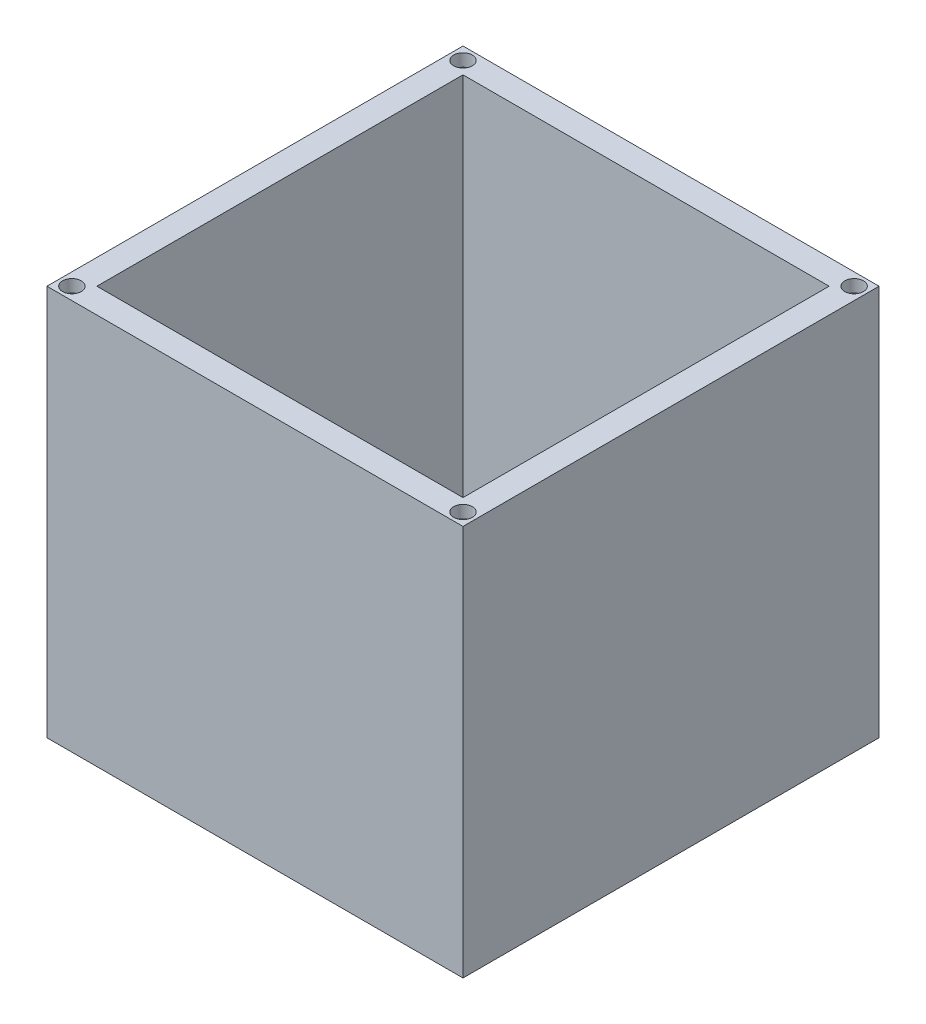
ISO-10303-21;
HEADER;
FILE_DESCRIPTION(('STEP AP214'),'2;1');
FILE_NAME('part.step','',(''),(''),'','','');
FILE_SCHEMA(('AUTOMOTIVE_DESIGN { 1 0 10303 214 1 1 1 1 }'));
ENDSEC;
DATA;
#1=APPLICATION_CONTEXT('core data for automotive mechanical design processes');
#2=APPLICATION_PROTOCOL_DEFINITION('international standard','automotive_design',2000,#1);
#3=PRODUCT_CONTEXT('',#1,'mechanical');
#4=PRODUCT('Part','Part','',(#3));
#5=PRODUCT_RELATED_PRODUCT_CATEGORY('part','',(#4));
#6=PRODUCT_DEFINITION_FORMATION('','',#4);
#7=PRODUCT_DEFINITION_CONTEXT('part definition',#1,'design');
#8=PRODUCT_DEFINITION('design','',#6,#7);
#9=PRODUCT_DEFINITION_SHAPE('','',#8);
#10=(LENGTH_UNIT() NAMED_UNIT(*) SI_UNIT(.MILLI.,.METRE.));
#11=(NAMED_UNIT(*) PLANE_ANGLE_UNIT() SI_UNIT($,.RADIAN.));
#12=(NAMED_UNIT(*) SI_UNIT($,.STERADIAN.) SOLID_ANGLE_UNIT());
#13=UNCERTAINTY_MEASURE_WITH_UNIT(LENGTH_MEASURE(1.E-05),#10,'distance_accuracy_value','');
#14=(GEOMETRIC_REPRESENTATION_CONTEXT(3) GLOBAL_UNCERTAINTY_ASSIGNED_CONTEXT((#13)) GLOBAL_UNIT_ASSIGNED_CONTEXT((#10,
#11,#12)) REPRESENTATION_CONTEXT('',''));
#15=CARTESIAN_POINT('',(0.,0.,0.));
#16=DIRECTION('',(0.,0.,1.));
#17=DIRECTION('',(1.,0.,0.));
#18=AXIS2_PLACEMENT_3D('',#15,#16,#17);
#19=CARTESIAN_POINT('',(50.,-94.,50.));
#20=DIRECTION('',(1.,0.,0.));
#21=DIRECTION('',(0.,0.,-1.));
#22=AXIS2_PLACEMENT_3D('',#19,#20,#21);
#23=PLANE('',#22);
#24=DIRECTION('',(0.,0.,-1.));
#25=VECTOR('',#24,1.);
#26=CARTESIAN_POINT('',(50.,0.,50.));
#27=LINE('',#26,#25);
#28=CARTESIAN_POINT('',(50.,0.,50.));
#29=VERTEX_POINT('',#28);
#30=CARTESIAN_POINT('',(50.,0.,-50.));
#31=VERTEX_POINT('',#30);
#32=EDGE_CURVE('E167',#29,#31,#27,.T.);
#33=ORIENTED_EDGE('',*,*,#32,.F.);
#34=DIRECTION('',(0.,1.,0.));
#35=VECTOR('',#34,1.);
#36=CARTESIAN_POINT('',(50.,-94.,50.));
#37=LINE('',#36,#35);
#38=CARTESIAN_POINT('',(50.,-94.,50.));
#39=VERTEX_POINT('',#38);
#40=EDGE_CURVE('E11',#39,#29,#37,.T.);
#41=ORIENTED_EDGE('',*,*,#40,.F.);
#42=DIRECTION('',(0.,0.,-1.));
#43=VECTOR('',#42,1.);
#44=CARTESIAN_POINT('',(50.,-94.,50.));
#45=LINE('',#44,#43);
#46=CARTESIAN_POINT('',(50.,-94.,-50.));
#47=VERTEX_POINT('',#46);
#48=EDGE_CURVE('E173',#39,#47,#45,.T.);
#49=ORIENTED_EDGE('',*,*,#48,.T.);
#50=DIRECTION('',(0.,1.,0.));
#51=VECTOR('',#50,1.);
#52=CARTESIAN_POINT('',(50.,-94.,-50.));
#53=LINE('',#52,#51);
#54=EDGE_CURVE('E48',#47,#31,#53,.T.);
#55=ORIENTED_EDGE('',*,*,#54,.T.);
#56=EDGE_LOOP('',(#33,#41,#49,#55));
#57=FACE_BOUND('',#56,.T.);
#58=ADVANCED_FACE('F45',(#57),#23,.T.);
#59=CARTESIAN_POINT('',(-50.,-94.,50.));
#60=DIRECTION('',(0.,0.,1.));
#61=DIRECTION('',(1.,0.,0.));
#62=AXIS2_PLACEMENT_3D('',#59,#60,#61);
#63=PLANE('',#62);
#64=DIRECTION('',(1.,0.,0.));
#65=VECTOR('',#64,1.);
#66=CARTESIAN_POINT('',(-50.,0.,50.));
#67=LINE('',#66,#65);
#68=CARTESIAN_POINT('',(-50.,0.,50.));
#69=VERTEX_POINT('',#68);
#70=EDGE_CURVE('E177',#69,#29,#67,.T.);
#71=ORIENTED_EDGE('',*,*,#70,.F.);
#72=DIRECTION('',(0.,1.,0.));
#73=VECTOR('',#72,1.);
#74=CARTESIAN_POINT('',(-50.,-94.,50.));
#75=LINE('',#74,#73);
#76=CARTESIAN_POINT('',(-50.,-94.,50.));
#77=VERTEX_POINT('',#76);
#78=EDGE_CURVE('E54',#77,#69,#75,.T.);
#79=ORIENTED_EDGE('',*,*,#78,.F.);
#80=DIRECTION('',(1.,0.,0.));
#81=VECTOR('',#80,1.);
#82=CARTESIAN_POINT('',(-50.,-94.,50.));
#83=LINE('',#82,#81);
#84=EDGE_CURVE('E184',#77,#39,#83,.T.);
#85=ORIENTED_EDGE('',*,*,#84,.T.);
#86=ORIENTED_EDGE('',*,*,#40,.T.);
#87=EDGE_LOOP('',(#71,#79,#85,#86));
#88=FACE_BOUND('',#87,.T.);
#89=ADVANCED_FACE('F209',(#88),#63,.T.);
#90=CARTESIAN_POINT('',(-50.,-94.,50.));
#91=DIRECTION('',(-1.,0.,0.));
#92=DIRECTION('',(0.,0.,1.));
#93=AXIS2_PLACEMENT_3D('',#90,#91,#92);
#94=PLANE('',#93);
#95=DIRECTION('',(0.,0.,1.));
#96=VECTOR('',#95,1.);
#97=CARTESIAN_POINT('',(-50.,0.,50.));
#98=LINE('',#97,#96);
#99=CARTESIAN_POINT('',(-50.,0.,-50.));
#100=VERTEX_POINT('',#99);
#101=EDGE_CURVE('E194',#100,#69,#98,.T.);
#102=ORIENTED_EDGE('',*,*,#101,.F.);
#103=DIRECTION('',(0.,1.,0.));
#104=VECTOR('',#103,1.);
#105=CARTESIAN_POINT('',(-50.,-94.,-50.));
#106=LINE('',#105,#104);
#107=CARTESIAN_POINT('',(-50.,-94.,-50.));
#108=VERTEX_POINT('',#107);
#109=EDGE_CURVE('E202',#108,#100,#106,.T.);
#110=ORIENTED_EDGE('',*,*,#109,.F.);
#111=DIRECTION('',(0.,0.,1.));
#112=VECTOR('',#111,1.);
#113=CARTESIAN_POINT('',(-50.,-94.,50.));
#114=LINE('',#113,#112);
#115=EDGE_CURVE('E180',#108,#77,#114,.T.);
#116=ORIENTED_EDGE('',*,*,#115,.T.);
#117=ORIENTED_EDGE('',*,*,#78,.T.);
#118=EDGE_LOOP('',(#102,#110,#116,#117));
#119=FACE_BOUND('',#118,.T.);
#120=ADVANCED_FACE('F213',(#119),#94,.T.);
#121=CARTESIAN_POINT('',(-50.,-94.,-50.));
#122=DIRECTION('',(0.,0.,-1.));
#123=DIRECTION('',(-1.,0.,0.));
#124=AXIS2_PLACEMENT_3D('',#121,#122,#123);
#125=PLANE('',#124);
#126=DIRECTION('',(-1.,0.,0.));
#127=VECTOR('',#126,1.);
#128=CARTESIAN_POINT('',(-50.,0.,-50.));
#129=LINE('',#128,#127);
#130=EDGE_CURVE('E190',#31,#100,#129,.T.);
#131=ORIENTED_EDGE('',*,*,#130,.F.);
#132=ORIENTED_EDGE('',*,*,#54,.F.);
#133=DIRECTION('',(-1.,0.,0.));
#134=VECTOR('',#133,1.);
#135=CARTESIAN_POINT('',(-50.,-94.,-50.));
#136=LINE('',#135,#134);
#137=EDGE_CURVE('E176',#47,#108,#136,.T.);
#138=ORIENTED_EDGE('',*,*,#137,.T.);
#139=ORIENTED_EDGE('',*,*,#109,.T.);
#140=EDGE_LOOP('',(#131,#132,#138,#139));
#141=FACE_BOUND('',#140,.T.);
#142=ADVANCED_FACE('F206',(#141),#125,.T.);
#143=CARTESIAN_POINT('',(0.,-94.,0.));
#144=DIRECTION('',(0.,-1.,0.));
#145=DIRECTION('',(0.,0.,-1.));
#146=AXIS2_PLACEMENT_3D('',#143,#144,#145);
#147=PLANE('',#146);
#148=ORIENTED_EDGE('',*,*,#48,.F.);
#149=ORIENTED_EDGE('',*,*,#84,.F.);
#150=ORIENTED_EDGE('',*,*,#115,.F.);
#151=ORIENTED_EDGE('',*,*,#137,.F.);
#152=EDGE_LOOP('',(#148,#149,#150,#151));
#153=FACE_BOUND('',#152,.T.);
#154=ADVANCED_FACE('F215',(#153),#147,.T.);
#155=CARTESIAN_POINT('',(0.,0.,0.));
#156=DIRECTION('',(0.,-1.,0.));
#157=DIRECTION('',(0.,0.,-1.));
#158=AXIS2_PLACEMENT_3D('',#155,#156,#157);
#159=PLANE('',#158);
#160=CARTESIAN_POINT('',(-47.0000000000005,0.,46.9999999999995));
#161=DIRECTION('',(0.,1.,0.));
#162=DIRECTION('',(0.,0.,1.));
#163=AXIS2_PLACEMENT_3D('',#160,#161,#162);
#164=CIRCLE('',#163,2.25);
#165=CARTESIAN_POINT('',(-47.0000000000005,0.,49.2499999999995));
#166=VERTEX_POINT('',#165);
#167=EDGE_CURVE('E382',#166,#166,#164,.T.);
#168=ORIENTED_EDGE('',*,*,#167,.F.);
#169=EDGE_LOOP('',(#168));
#170=FACE_BOUND('',#169,.T.);
#171=CARTESIAN_POINT('',(47.0000000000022,0.,47.0000000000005));
#172=DIRECTION('',(0.,1.,0.));
#173=DIRECTION('',(0.,0.,1.));
#174=AXIS2_PLACEMENT_3D('',#171,#172,#173);
#175=CIRCLE('',#174,2.25000000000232);
#176=CARTESIAN_POINT('',(47.0000000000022,0.,49.2500000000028));
#177=VERTEX_POINT('',#176);
#178=EDGE_CURVE('E405',#177,#177,#175,.T.);
#179=ORIENTED_EDGE('',*,*,#178,.F.);
#180=EDGE_LOOP('',(#179));
#181=FACE_BOUND('',#180,.T.);
#182=CARTESIAN_POINT('',(47.0000000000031,0.,-47.0000000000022));
#183=DIRECTION('',(0.,1.,0.));
#184=DIRECTION('',(0.,0.,1.));
#185=AXIS2_PLACEMENT_3D('',#182,#183,#184);
#186=CIRCLE('',#185,2.25000000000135);
#187=CARTESIAN_POINT('',(47.0000000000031,0.,-44.7500000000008));
#188=VERTEX_POINT('',#187);
#189=EDGE_CURVE('E394',#188,#188,#186,.T.);
#190=ORIENTED_EDGE('',*,*,#189,.F.);
#191=EDGE_LOOP('',(#190));
#192=FACE_BOUND('',#191,.T.);
#193=CARTESIAN_POINT('',(-46.9999999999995,0.,-47.0000000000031));
#194=DIRECTION('',(0.,1.,0.));
#195=DIRECTION('',(0.,0.,1.));
#196=AXIS2_PLACEMENT_3D('',#193,#194,#195);
#197=CIRCLE('',#196,2.24999999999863);
#198=CARTESIAN_POINT('',(-46.9999999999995,0.,-44.7500000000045));
#199=VERTEX_POINT('',#198);
#200=EDGE_CURVE('E148',#199,#199,#197,.T.);
#201=ORIENTED_EDGE('',*,*,#200,.F.);
#202=EDGE_LOOP('',(#201));
#203=FACE_BOUND('',#202,.T.);
#204=DIRECTION('',(-1.,0.,0.));
#205=VECTOR('',#204,1.);
#206=CARTESIAN_POINT('',(-44.,0.,-44.));
#207=LINE('',#206,#205);
#208=CARTESIAN_POINT('',(44.,0.,-44.));
#209=VERTEX_POINT('',#208);
#210=CARTESIAN_POINT('',(-44.,0.,-44.));
#211=VERTEX_POINT('',#210);
#212=EDGE_CURVE('E157',#209,#211,#207,.T.);
#213=ORIENTED_EDGE('',*,*,#212,.F.);
#214=DIRECTION('',(0.,0.,-1.));
#215=VECTOR('',#214,1.);
#216=CARTESIAN_POINT('',(44.,0.,44.));
#217=LINE('',#216,#215);
#218=CARTESIAN_POINT('',(44.,0.,44.));
#219=VERTEX_POINT('',#218);
#220=EDGE_CURVE('E62',#219,#209,#217,.T.);
#221=ORIENTED_EDGE('',*,*,#220,.F.);
#222=DIRECTION('',(1.,0.,0.));
#223=VECTOR('',#222,1.);
#224=CARTESIAN_POINT('',(-44.,0.,44.));
#225=LINE('',#224,#223);
#226=CARTESIAN_POINT('',(-44.,0.,44.));
#227=VERTEX_POINT('',#226);
#228=EDGE_CURVE('E141',#227,#219,#225,.T.);
#229=ORIENTED_EDGE('',*,*,#228,.F.);
#230=DIRECTION('',(0.,0.,1.));
#231=VECTOR('',#230,1.);
#232=CARTESIAN_POINT('',(-44.,0.,44.));
#233=LINE('',#232,#231);
#234=EDGE_CURVE('E145',#211,#227,#233,.T.);
#235=ORIENTED_EDGE('',*,*,#234,.F.);
#236=EDGE_LOOP('',(#213,#221,#229,#235));
#237=FACE_BOUND('',#236,.T.);
#238=ORIENTED_EDGE('',*,*,#32,.T.);
#239=ORIENTED_EDGE('',*,*,#130,.T.);
#240=ORIENTED_EDGE('',*,*,#101,.T.);
#241=ORIENTED_EDGE('',*,*,#70,.T.);
#242=EDGE_LOOP('',(#238,#239,#240,#241));
#243=FACE_BOUND('',#242,.T.);
#244=ADVANCED_FACE('F208',(#170,#181,#192,#203,#237,#243),#159,.F.);
#245=CARTESIAN_POINT('',(44.,-88.,44.));
#246=DIRECTION('',(1.,0.,0.));
#247=DIRECTION('',(0.,0.,-1.));
#248=AXIS2_PLACEMENT_3D('',#245,#246,#247);
#249=PLANE('',#248);
#250=ORIENTED_EDGE('',*,*,#220,.T.);
#251=DIRECTION('',(0.,1.,0.));
#252=VECTOR('',#251,1.);
#253=CARTESIAN_POINT('',(44.,-88.,-44.));
#254=LINE('',#253,#252);
#255=CARTESIAN_POINT('',(44.,-88.,-44.));
#256=VERTEX_POINT('',#255);
#257=EDGE_CURVE('E116',#256,#209,#254,.T.);
#258=ORIENTED_EDGE('',*,*,#257,.F.);
#259=DIRECTION('',(0.,0.,-1.));
#260=VECTOR('',#259,1.);
#261=CARTESIAN_POINT('',(44.,-88.,44.));
#262=LINE('',#261,#260);
#263=CARTESIAN_POINT('',(44.,-88.,44.));
#264=VERTEX_POINT('',#263);
#265=EDGE_CURVE('E120',#264,#256,#262,.T.);
#266=ORIENTED_EDGE('',*,*,#265,.F.);
#267=DIRECTION('',(0.,1.,0.));
#268=VECTOR('',#267,1.);
#269=CARTESIAN_POINT('',(44.,-88.,44.));
#270=LINE('',#269,#268);
#271=EDGE_CURVE('E164',#264,#219,#270,.T.);
#272=ORIENTED_EDGE('',*,*,#271,.T.);
#273=EDGE_LOOP('',(#250,#258,#266,#272));
#274=FACE_BOUND('',#273,.T.);
#275=ADVANCED_FACE('F118',(#274),#249,.F.);
#276=CARTESIAN_POINT('',(-44.,-88.,44.));
#277=DIRECTION('',(0.,0.,1.));
#278=DIRECTION('',(1.,0.,0.));
#279=AXIS2_PLACEMENT_3D('',#276,#277,#278);
#280=PLANE('',#279);
#281=ORIENTED_EDGE('',*,*,#228,.T.);
#282=ORIENTED_EDGE('',*,*,#271,.F.);
#283=DIRECTION('',(1.,0.,0.));
#284=VECTOR('',#283,1.);
#285=CARTESIAN_POINT('',(-44.,-88.,44.));
#286=LINE('',#285,#284);
#287=CARTESIAN_POINT('',(-44.,-88.,44.));
#288=VERTEX_POINT('',#287);
#289=EDGE_CURVE('E127',#288,#264,#286,.T.);
#290=ORIENTED_EDGE('',*,*,#289,.F.);
#291=DIRECTION('',(0.,1.,0.));
#292=VECTOR('',#291,1.);
#293=CARTESIAN_POINT('',(-44.,-88.,44.));
#294=LINE('',#293,#292);
#295=EDGE_CURVE('E168',#288,#227,#294,.T.);
#296=ORIENTED_EDGE('',*,*,#295,.T.);
#297=EDGE_LOOP('',(#281,#282,#290,#296));
#298=FACE_BOUND('',#297,.T.);
#299=ADVANCED_FACE('F263',(#298),#280,.F.);
#300=CARTESIAN_POINT('',(-44.,-88.,44.));
#301=DIRECTION('',(-1.,0.,0.));
#302=DIRECTION('',(0.,0.,1.));
#303=AXIS2_PLACEMENT_3D('',#300,#301,#302);
#304=PLANE('',#303);
#305=ORIENTED_EDGE('',*,*,#234,.T.);
#306=ORIENTED_EDGE('',*,*,#295,.F.);
#307=DIRECTION('',(0.,0.,1.));
#308=VECTOR('',#307,1.);
#309=CARTESIAN_POINT('',(-44.,-88.,44.));
#310=LINE('',#309,#308);
#311=CARTESIAN_POINT('',(-44.,-88.,-44.));
#312=VERTEX_POINT('',#311);
#313=EDGE_CURVE('E136',#312,#288,#310,.T.);
#314=ORIENTED_EDGE('',*,*,#313,.F.);
#315=DIRECTION('',(0.,1.,0.));
#316=VECTOR('',#315,1.);
#317=CARTESIAN_POINT('',(-44.,-88.,-44.));
#318=LINE('',#317,#316);
#319=EDGE_CURVE('E126',#312,#211,#318,.T.);
#320=ORIENTED_EDGE('',*,*,#319,.T.);
#321=EDGE_LOOP('',(#305,#306,#314,#320));
#322=FACE_BOUND('',#321,.T.);
#323=ADVANCED_FACE('F271',(#322),#304,.F.);
#324=CARTESIAN_POINT('',(-44.,-88.,-44.));
#325=DIRECTION('',(0.,0.,-1.));
#326=DIRECTION('',(-1.,0.,0.));
#327=AXIS2_PLACEMENT_3D('',#324,#325,#326);
#328=PLANE('',#327);
#329=ORIENTED_EDGE('',*,*,#212,.T.);
#330=ORIENTED_EDGE('',*,*,#319,.F.);
#331=DIRECTION('',(-1.,0.,0.));
#332=VECTOR('',#331,1.);
#333=CARTESIAN_POINT('',(-44.,-88.,-44.));
#334=LINE('',#333,#332);
#335=EDGE_CURVE('E130',#256,#312,#334,.T.);
#336=ORIENTED_EDGE('',*,*,#335,.F.);
#337=ORIENTED_EDGE('',*,*,#257,.T.);
#338=EDGE_LOOP('',(#329,#330,#336,#337));
#339=FACE_BOUND('',#338,.T.);
#340=ADVANCED_FACE('F131',(#339),#328,.F.);
#341=CARTESIAN_POINT('',(0.,-88.,0.));
#342=DIRECTION('',(0.,-1.,0.));
#343=DIRECTION('',(0.,0.,-1.));
#344=AXIS2_PLACEMENT_3D('',#341,#342,#343);
#345=PLANE('',#344);
#346=ORIENTED_EDGE('',*,*,#265,.T.);
#347=ORIENTED_EDGE('',*,*,#335,.T.);
#348=ORIENTED_EDGE('',*,*,#313,.T.);
#349=ORIENTED_EDGE('',*,*,#289,.T.);
#350=EDGE_LOOP('',(#346,#347,#348,#349));
#351=FACE_BOUND('',#350,.T.);
#352=ADVANCED_FACE('F138',(#351),#345,.F.);
#353=CARTESIAN_POINT('',(-46.9999999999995,-3.,-47.0000000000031));
#354=DIRECTION('',(0.,1.,0.));
#355=DIRECTION('',(0.,0.,1.));
#356=AXIS2_PLACEMENT_3D('',#353,#354,#355);
#357=CYLINDRICAL_SURFACE('',#356,2.24999999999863);
#358=CARTESIAN_POINT('',(-46.9999999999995,-3.,-47.0000000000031));
#359=DIRECTION('',(0.,1.,0.));
#360=DIRECTION('',(0.,0.,1.));
#361=AXIS2_PLACEMENT_3D('',#358,#359,#360);
#362=CIRCLE('',#361,2.24999999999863);
#363=CARTESIAN_POINT('',(-46.9999999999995,-3.,-44.7500000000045));
#364=VERTEX_POINT('',#363);
#365=EDGE_CURVE('E158',#364,#364,#362,.T.);
#366=ORIENTED_EDGE('',*,*,#365,.F.);
#367=EDGE_LOOP('',(#366));
#368=FACE_BOUND('',#367,.T.);
#369=ORIENTED_EDGE('',*,*,#200,.T.);
#370=EDGE_LOOP('',(#369));
#371=FACE_BOUND('',#370,.T.);
#372=ADVANCED_FACE('F297',(#368,#371),#357,.F.);
#373=CARTESIAN_POINT('',(-46.9999999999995,-3.,-47.0000000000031));
#374=DIRECTION('',(0.,1.,0.));
#375=DIRECTION('',(0.,0.,1.));
#376=AXIS2_PLACEMENT_3D('',#373,#374,#375);
#377=PLANE('',#376);
#378=ORIENTED_EDGE('',*,*,#365,.T.);
#379=EDGE_LOOP('',(#378));
#380=FACE_BOUND('',#379,.T.);
#381=ADVANCED_FACE('F305',(#380),#377,.T.);
#382=CARTESIAN_POINT('',(47.0000000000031,-3.,-47.0000000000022));
#383=DIRECTION('',(0.,1.,0.));
#384=DIRECTION('',(0.,0.,1.));
#385=AXIS2_PLACEMENT_3D('',#382,#383,#384);
#386=CYLINDRICAL_SURFACE('',#385,2.25000000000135);
#387=CARTESIAN_POINT('',(47.0000000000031,-3.,-47.0000000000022));
#388=DIRECTION('',(0.,1.,0.));
#389=DIRECTION('',(0.,0.,1.));
#390=AXIS2_PLACEMENT_3D('',#387,#388,#389);
#391=CIRCLE('',#390,2.25000000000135);
#392=CARTESIAN_POINT('',(47.0000000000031,-3.,-44.7500000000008));
#393=VERTEX_POINT('',#392);
#394=EDGE_CURVE('E399',#393,#393,#391,.T.);
#395=ORIENTED_EDGE('',*,*,#394,.F.);
#396=EDGE_LOOP('',(#395));
#397=FACE_BOUND('',#396,.T.);
#398=ORIENTED_EDGE('',*,*,#189,.T.);
#399=EDGE_LOOP('',(#398));
#400=FACE_BOUND('',#399,.T.);
#401=ADVANCED_FACE('F315',(#397,#400),#386,.F.);
#402=CARTESIAN_POINT('',(47.0000000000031,-3.,-47.0000000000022));
#403=DIRECTION('',(0.,1.,0.));
#404=DIRECTION('',(0.,0.,1.));
#405=AXIS2_PLACEMENT_3D('',#402,#403,#404);
#406=PLANE('',#405);
#407=ORIENTED_EDGE('',*,*,#394,.T.);
#408=EDGE_LOOP('',(#407));
#409=FACE_BOUND('',#408,.T.);
#410=ADVANCED_FACE('F325',(#409),#406,.T.);
#411=CARTESIAN_POINT('',(47.0000000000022,-3.,47.0000000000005));
#412=DIRECTION('',(0.,1.,0.));
#413=DIRECTION('',(0.,0.,1.));
#414=AXIS2_PLACEMENT_3D('',#411,#412,#413);
#415=CYLINDRICAL_SURFACE('',#414,2.25000000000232);
#416=CARTESIAN_POINT('',(47.0000000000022,-3.,47.0000000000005));
#417=DIRECTION('',(0.,1.,0.));
#418=DIRECTION('',(0.,0.,1.));
#419=AXIS2_PLACEMENT_3D('',#416,#417,#418);
#420=CIRCLE('',#419,2.25000000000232);
#421=CARTESIAN_POINT('',(47.0000000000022,-3.,49.2500000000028));
#422=VERTEX_POINT('',#421);
#423=EDGE_CURVE('E386',#422,#422,#420,.T.);
#424=ORIENTED_EDGE('',*,*,#423,.F.);
#425=EDGE_LOOP('',(#424));
#426=FACE_BOUND('',#425,.T.);
#427=ORIENTED_EDGE('',*,*,#178,.T.);
#428=EDGE_LOOP('',(#427));
#429=FACE_BOUND('',#428,.T.);
#430=ADVANCED_FACE('F335',(#426,#429),#415,.F.);
#431=CARTESIAN_POINT('',(47.0000000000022,-3.,47.0000000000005));
#432=DIRECTION('',(0.,1.,0.));
#433=DIRECTION('',(0.,0.,1.));
#434=AXIS2_PLACEMENT_3D('',#431,#432,#433);
#435=PLANE('',#434);
#436=ORIENTED_EDGE('',*,*,#423,.T.);
#437=EDGE_LOOP('',(#436));
#438=FACE_BOUND('',#437,.T.);
#439=ADVANCED_FACE('F345',(#438),#435,.T.);
#440=CARTESIAN_POINT('',(-47.0000000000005,-3.,46.9999999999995));
#441=DIRECTION('',(0.,1.,0.));
#442=DIRECTION('',(0.,0.,1.));
#443=AXIS2_PLACEMENT_3D('',#440,#441,#442);
#444=CYLINDRICAL_SURFACE('',#443,2.25);
#445=CARTESIAN_POINT('',(-47.0000000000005,-3.,46.9999999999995));
#446=DIRECTION('',(0.,1.,0.));
#447=DIRECTION('',(0.,0.,1.));
#448=AXIS2_PLACEMENT_3D('',#445,#446,#447);
#449=CIRCLE('',#448,2.25);
#450=CARTESIAN_POINT('',(-47.0000000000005,-3.,49.2499999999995));
#451=VERTEX_POINT('',#450);
#452=EDGE_CURVE('E380',#451,#451,#449,.T.);
#453=ORIENTED_EDGE('',*,*,#452,.F.);
#454=EDGE_LOOP('',(#453));
#455=FACE_BOUND('',#454,.T.);
#456=ORIENTED_EDGE('',*,*,#167,.T.);
#457=EDGE_LOOP('',(#456));
#458=FACE_BOUND('',#457,.T.);
#459=ADVANCED_FACE('F355',(#455,#458),#444,.F.);
#460=CARTESIAN_POINT('',(-47.0000000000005,-3.,46.9999999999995));
#461=DIRECTION('',(0.,1.,0.));
#462=DIRECTION('',(0.,0.,1.));
#463=AXIS2_PLACEMENT_3D('',#460,#461,#462);
#464=PLANE('',#463);
#465=ORIENTED_EDGE('',*,*,#452,.T.);
#466=EDGE_LOOP('',(#465));
#467=FACE_BOUND('',#466,.T.);
#468=ADVANCED_FACE('F365',(#467),#464,.T.);
#469=CLOSED_SHELL('',(#58,#89,#120,#142,#154,#244,#275,#299,#323,#340,#352,#372,#381,#401,#410,
#430,#439,#459,#468));
#470=MANIFOLD_SOLID_BREP('B2',#469);
#471=ADVANCED_BREP_SHAPE_REPRESENTATION('',(#18,#470),#14);
#472=SHAPE_DEFINITION_REPRESENTATION(#9,#471);
ENDSEC;
END-ISO-10303-21;
